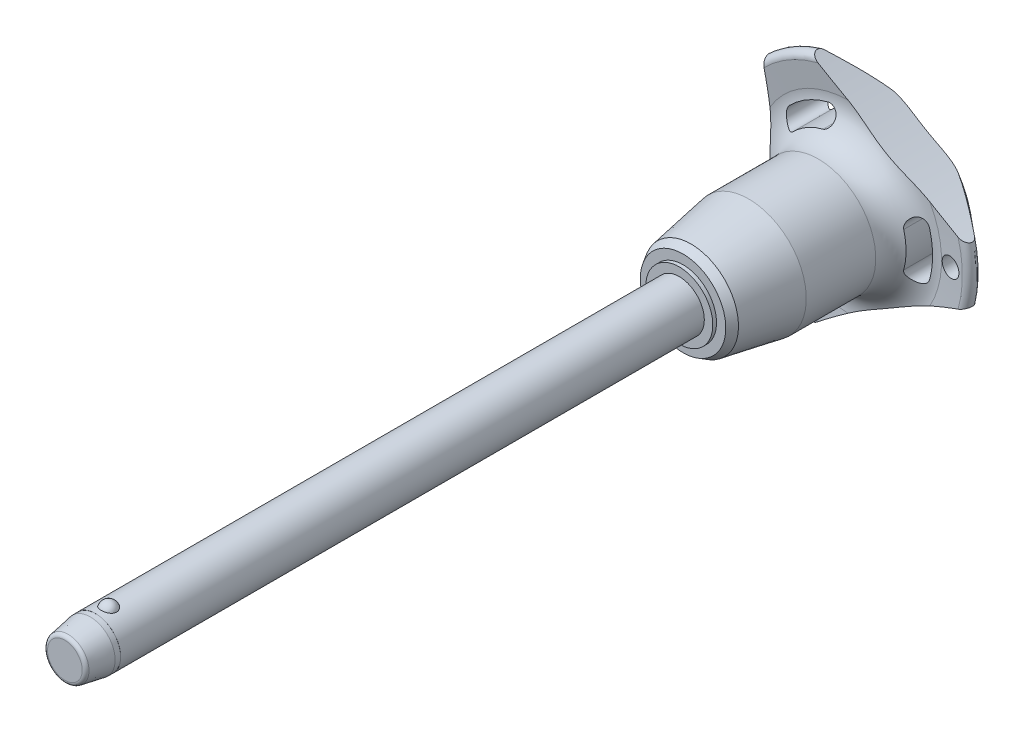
from build123d import *

# Parameters (mm, degrees)
SKETCH1_R           = 4
BOSS_EXTRUDE1_DEPTH = 90
SKETCH2_R           = 3.4
BOSS_EXTRUDE2_DEPTH = 33.3
BOSS_EXTRUDE3_START = 8.2
SKETCH1_2_R         = 4
BOSS_EXTRUDE3_DEPTH = 8.2
CHAMFER1_SIZE       = 4.1
CHAMFER1_SIZE2      = 0.722940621
FILLET1_R           = 0.6
SKETCH6_R           = 102.8
CUT_EXTRUDE1_DEPTH  = 127.380768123
CIRPATTERN1_COUNT   = 3
SKETCH7_R           = 1.5
CUT_EXTRUDE2_DEPTH  = 127.252726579
SKETCH8_R           = 4
SKETCH8_R_2         = 3.99
CUT_EXTRUDE3_DEPTH  = 4.92


with BuildPart() as part:
    # Sketch1 → Boss-Extrude1 (new body)
    with BuildSketch(Plane.XY):
        Circle(SKETCH1_R)
    extrude(amount=-BOSS_EXTRUDE1_DEPTH)

    # Sketch2 → Boss-Extrude2 (add)
    with BuildSketch(Plane(origin=(0, 0, -90), x_dir=(-1, 0, 0), z_dir=(0, 0, -1))):
        Circle(SKETCH2_R)
    extrude(amount=BOSS_EXTRUDE2_DEPTH)

    # Sketch3 → Revolve1 (revolve)
    with BuildSketch(Plane(origin=(0, 0, 0), x_dir=(0, 0, -1), z_dir=(1, 0, 0))):
        with BuildLine():
            Line((-1.2, 4.8), (-1.2, 2.2))
            ThreePointArc((-1.2, 2.2), (0.1, 3.5), (-1.2, 4.8))
        make_face()
        with BuildLine():
            Line((-1.2, -2.2), (-1.2, -4.8))
            ThreePointArc((-1.2, -4.8), (0.1, -3.5), (-1.2, -2.2))
        make_face()
    revolve(axis=Axis((0, -2.2, 1.2), (0, 1, 0)))

    # Sketch1_2 → Boss-Extrude3 (add)
    with BuildSketch(Plane.XY.offset(BOSS_EXTRUDE3_START)):
        Circle(SKETCH1_2_R)
    extrude(amount=-BOSS_EXTRUDE3_DEPTH)

    # Chamfer1
    chamfer1_edges = [part.edges().sort_by_distance(p)[0] for p in [
        (-4, 0, 8.2),
    ]]
    chamfer1_side = [part.faces().sort_by_distance(p)[0] for p in [
        (-4, 0, -40.9),
    ]]
    chamfer(chamfer1_edges, length=CHAMFER1_SIZE, length2=CHAMFER1_SIZE2, reference=chamfer1_side[0])

    # Fillet1
    fillet1_edges = [part.edges().sort_by_distance(p)[0] for p in [
        (-3.277059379, 0, 8.2),
        (3.4, 0, -123.3),
    ]]
    fillet(fillet1_edges, radius=FILLET1_R)

    # Sketch4 → Revolve2 (revolve)
    with BuildSketch(Plane(origin=(0, 0, 0), x_dir=(0, 0, -1), z_dir=(1, 0, 0)), mode=Mode.PRIVATE) as revolve2_sk:
        Polygon((90, 0), (90, 5.353660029), (90.6, 5.353660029), (90.6, 6.834334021), (91.882301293, 7.574671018), (101.1, 9.2), (112.2, 9.2), (112.2, 0), align=None)
    revolve(revolve2_sk.sketch.rotate(Axis((0, 0, -112.2), (0, 0, 1)), 90), axis=Axis((0, 0, -112.2), (0, 0, 1)))

    # Sketch5 → Revolve3 (revolve)
    with BuildSketch(Plane(origin=(0, 0, 0), x_dir=(0, 0, -1), z_dir=(1, 0, 0)), mode=Mode.PRIVATE) as revolve3_sk:
        with BuildLine():
            Line((117.169704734, 14.749576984), (116.756059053, 18.490084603))
            ThreePointArc((116.756059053, 18.490084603), (117.35677658, 19.519442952), (118.516044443, 19.24278761))
            Line((118.516044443, 19.24278761), (122.835691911, 14.094832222))
            ThreePointArc((122.835691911, 14.094832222), (123.3, 12.689260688), (122.67067517, 11.349423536))
            ThreePointArc((122.67067517, 11.349423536), (119.033110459, 6.185112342), (117.75, 0))
            Line((117.75, 0), (112.2, 0))
            Line((112.2, 0), (112.2, 9.2))
            ThreePointArc((112.2, 9.2), (115.924774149, 10.864425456), (117.169704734, 14.749576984))
        make_face()
    revolve(revolve3_sk.sketch.rotate(Axis((0, 0, -117.75), (0, 0, 1)), 90), axis=Axis((0, 0, -117.75), (0, 0, 1)))

    # Sketch6 → Cut-Extrude1 (cut, through all)
    with BuildSketch(Plane.XY):
        with Locations((-115.2, 0)):
            Circle(SKETCH6_R)
        with BuildLine():
            ThreePointArc((12.885043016, -3.538869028), (13.362182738, 0), (12.885043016, 3.538869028))
            ThreePointArc((12.885043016, 3.538869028), (11.179749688, 4.509281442), (10.209337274, 2.803988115))
            ThreePointArc((10.209337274, 2.803988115), (10.587394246, 0), (10.209337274, -2.803988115))
            ThreePointArc((10.209337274, -2.803988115), (11.179749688, -4.509281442), (12.885043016, -3.538869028))
        make_face()
    cut_extrude1 = extrude(amount=-CUT_EXTRUDE1_DEPTH, mode=Mode.SUBTRACT)

    # CirPattern1: Cut-Extrude1 ×3 about axis
    cirpattern1_axis = Axis((0, 0, 0), (0, 0, 1))
    for i in range(1, CIRPATTERN1_COUNT):
        add(cut_extrude1.rotate(cirpattern1_axis, i * 360 / CIRPATTERN1_COUNT), mode=Mode.SUBTRACT)

    # Sketch7 → Cut-Extrude2 (cut, through all)
    with BuildSketch(Plane.XY):
        with Locations(Location((16.362182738, 0, 0), (0, 0, 225.449470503))):
            Circle(SKETCH7_R)
    extrude(amount=-CUT_EXTRUDE2_DEPTH, mode=Mode.SUBTRACT)

    # Sketch8 → Cut-Extrude3 (cut)
    with BuildSketch(Plane.XY.offset(8.2)):
        Circle(SKETCH8_R)
        Circle(SKETCH8_R_2, mode=Mode.SUBTRACT)
    extrude(amount=-CUT_EXTRUDE3_DEPTH, mode=Mode.SUBTRACT)


solid = part.part
